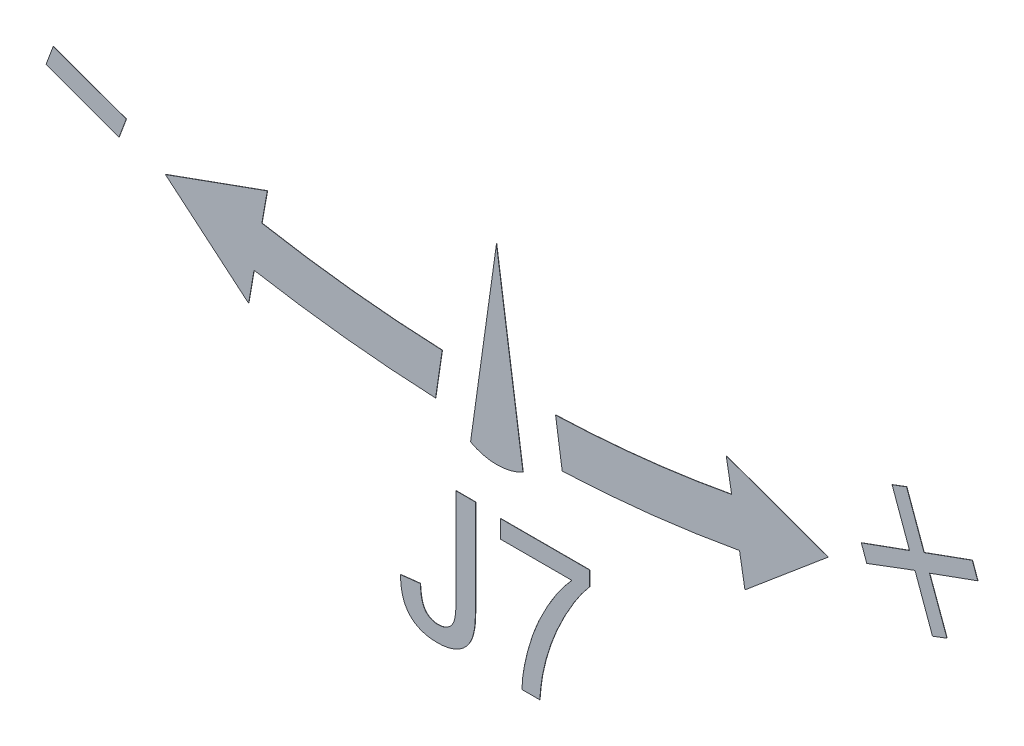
from build123d import *

# Parameters (mm, degrees)
BOSS_EXTRUDE1_DEPTH   = 0.25
BOSS_EXTRUDE1_2_DEPTH = 0.25
BOSS_EXTRUDE2_DEPTH   = 0.25
BOSS_EXTRUDE2_2_DEPTH = 0.25
BOSS_EXTRUDE2_3_DEPTH = 0.25
BOSS_EXTRUDE2_4_DEPTH = 0.25
BOSS_EXTRUDE2_5_DEPTH = 0.25
SCALE1_SCALE          = 0.040197


with BuildPart() as part:
    # Sketch3 → Boss-Extrude1 (new body)
    with BuildSketch(Plane.XY):
        with BuildLine():
            Line((4414.576181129, 1815.791045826), (4432.063360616, 1817.75338557))
            add(Edge.make_bspline(
                [(4432.063360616, 1817.75338557), (4432.110607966, 1816.651475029), (4432.200990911, 1814.543548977), (4432.500644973, 1811.517332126), (4432.918954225, 1808.764913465), (4433.436964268, 1806.276241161), (4434.040434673, 1804.049587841), (4434.79758805, 1802.102917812), (4435.613036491, 1800.395330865), (4436.615641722, 1798.979945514), (4437.69060692, 1797.770283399), (4438.873162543, 1796.743166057), (4440.148053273, 1795.867922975), (4441.512738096, 1795.144904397), (4442.982571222, 1794.590316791), (4444.542273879, 1794.205080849), (4446.204703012, 1793.938391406), (4447.346964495, 1793.917832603), (4447.93595677, 1793.907231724)],
                knots=[0, 0, 0, 0, 1.632619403, 3.123158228, 4.499702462, 5.75227728, 6.885496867, 7.90993266, 8.841891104, 9.678429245, 10.468404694, 11.232957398, 11.991194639, 12.753385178, 13.513799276, 14.310593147, 15.128879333, 16, 16, 16, 16], degree=3))
            add(Edge.make_bspline(
                [(4447.93595677, 1793.907231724), (4448.792276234, 1793.935888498), (4450.46552378, 1793.991883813), (4452.865600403, 1794.567384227), (4455.10189284, 1795.430836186), (4457.111151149, 1796.691604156), (4458.902543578, 1798.225712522), (4460.426345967, 1800.036056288), (4461.587077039, 1802.128236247), (4462.318129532, 1804.059889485), (4462.766562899, 1805.779153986), (4463.060038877, 1807.272715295), (4463.307454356, 1808.938944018), (4463.494331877, 1810.78828321), (4463.684056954, 1812.815367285), (4463.759850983, 1815.029057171), (4463.848195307, 1817.413230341), (4463.85480964, 1819.061500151), (4463.858232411, 1819.914443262)],
                knots=[0, 0, 0, 0, 1.177507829, 2.300849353, 3.381033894, 4.466744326, 5.550475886, 6.619462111, 7.707386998, 8.830091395, 9.455333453, 10.153234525, 10.925888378, 11.774835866, 12.713513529, 13.729654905, 14.82514671, 16, 16, 16, 16], degree=3))
            Line((4463.858232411, 1819.914443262), (4463.858232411, 1905.189283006))
            Line((4463.858232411, 1905.189283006), (4481.345411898, 1905.189283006))
            Line((4481.345411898, 1905.189283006), (4481.345411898, 1821.032231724))
            add(Edge.make_bspline(
                [(4481.345411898, 1821.032231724), (4481.33826824, 1819.773493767), (4481.324443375, 1817.337503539), (4481.150115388, 1813.790618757), (4480.846920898, 1810.461095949), (4480.466055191, 1807.341630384), (4479.943616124, 1804.438814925), (4479.29731468, 1801.762333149), (4478.564893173, 1799.290452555), (4477.415320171, 1796.340231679), (4475.665037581, 1792.993156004), (4472.986793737, 1789.443328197), (4469.74972764, 1786.415066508), (4465.990537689, 1783.922695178), (4461.799435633, 1781.999223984), (4457.248675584, 1780.60269331), (4452.348779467, 1779.738468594), (4448.95804093, 1779.646698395), (4447.215604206, 1779.599539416)],
                knots=[0, 0, 0, 0, 0.979376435, 1.895351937, 2.762129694, 3.580429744, 4.339931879, 5.055623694, 5.722093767, 6.344240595, 7.517202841, 8.648554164, 9.788057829, 10.949533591, 12.142879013, 13.363546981, 14.645176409, 16, 16, 16, 16], degree=3))
            add(Edge.make_bspline(
                [(4447.215604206, 1779.599539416), (4445.922542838, 1779.62778786), (4443.403805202, 1779.682812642), (4439.741987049, 1780.120221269), (4436.3010386, 1780.778059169), (4433.123744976, 1781.836196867), (4430.145645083, 1783.074237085), (4427.42438489, 1784.665391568), (4424.913384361, 1786.501247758), (4422.676218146, 1788.660512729), (4420.658904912, 1791.073042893), (4418.990808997, 1793.814014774), (4417.516645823, 1796.784257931), (4416.403723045, 1800.066503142), (4415.490830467, 1803.599877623), (4414.926172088, 1807.42946312), (4414.555284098, 1811.519435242), (4414.569088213, 1814.341166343), (4414.576181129, 1815.791045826)],
                knots=[0, 0, 0, 0, 1.110149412, 2.162445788, 3.163771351, 4.112774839, 5.033433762, 5.928696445, 6.813333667, 7.698542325, 8.592646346, 9.506220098, 10.44759987, 11.434914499, 12.476633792, 13.577933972, 14.755478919, 16, 16, 16, 16], degree=3))
        make_face()
    extrude(amount=BOSS_EXTRUDE1_DEPTH)


with BuildPart() as body_2:
    # Sketch3 → Boss-Extrude1 2 (new body)
    with BuildSketch(Plane.XY):
        with BuildLine():
            Line((4503.601822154, 1887.702103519), (4503.601822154, 1903.599539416))
            Line((4503.601822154, 1903.599539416), (4583.089001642, 1903.599539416))
            Line((4583.089001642, 1903.599539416), (4583.089001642, 1890.732552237))
            add(Edge.make_bspline(
                [(4583.089001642, 1890.732552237), (4582.153230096, 1889.638245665), (4580.239905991, 1887.40077312), (4577.468065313, 1883.836838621), (4574.681821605, 1880.042464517), (4571.930148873, 1875.981164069), (4569.171931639, 1871.682576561), (4566.418270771, 1867.132973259), (4563.657924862, 1862.343435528), (4560.037177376, 1855.637149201), (4555.717438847, 1847.051411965), (4551.228820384, 1836.472238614), (4547.243964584, 1825.787621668), (4545.123405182, 1818.521055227), (4544.065764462, 1814.896815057)],
                knots=[0, 0, 0, 0, 0.603281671, 1.233499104, 1.891379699, 2.575603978, 3.288773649, 4.031381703, 4.80386477, 5.604951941, 7.224880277, 8.828980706, 10.418436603, 12, 12, 12, 12], degree=3))
            add(Edge.make_bspline(
                [(4544.065764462, 1814.896815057), (4543.379839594, 1812.279385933), (4541.984413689, 1806.954563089), (4540.456852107, 1798.685787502), (4539.275820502, 1790.064343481), (4538.812051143, 1784.181339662), (4538.576181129, 1781.189283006)],
                knots=[0, 0, 0, 0, 0.948866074, 1.930345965, 2.947387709, 4, 4, 4, 4], degree=3))
            Line((4538.576181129, 1781.189283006), (4522.678745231, 1781.189283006))
            add(Edge.make_bspline(
                [(4522.678745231, 1781.189283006), (4522.716876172, 1782.423640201), (4522.795290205, 1784.962023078), (4523.142043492, 1788.862518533), (4523.603887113, 1792.956838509), (4524.256202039, 1797.231151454), (4525.085347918, 1801.694133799), (4526.073383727, 1806.350512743), (4527.253387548, 1811.190657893), (4528.998545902, 1817.901201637), (4531.590389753, 1826.339156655), (4535.363926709, 1836.316264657), (4539.703596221, 1846.122165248), (4543.845474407, 1854.074231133), (4547.377483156, 1860.266665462), (4550.057788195, 1864.759754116), (4552.814312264, 1869.041170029), (4555.595951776, 1873.141712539), (4558.403188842, 1877.064834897), (4561.293208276, 1880.773866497), (4564.180802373, 1884.343321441), (4566.196828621, 1886.592383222), (4567.191565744, 1887.702103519)],
                knots=[0, 0, 0, 0, 0.630312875, 1.296201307, 1.998242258, 2.7335219, 3.502880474, 4.315318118, 5.163159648, 6.045885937, 7.85484959, 9.666009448, 11.488277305, 13.325849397, 14.240191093, 15.127469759, 15.996293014, 16.839220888, 17.656853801, 18.458354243, 19.239329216, 20, 20, 20, 20], degree=3))
            Line((4567.191565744, 1887.702103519), (4503.601822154, 1887.702103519))
        make_face()
    extrude(amount=BOSS_EXTRUDE1_2_DEPTH)


with BuildPart() as body_3:
    # Sketch2 → Boss-Extrude2 (new body)
    with BuildSketch(Plane.XY):
        Polygon((4169.8841418, 2045.1572), (4104.8305, 2068.8130582), (4098.3789, 2051.6088), (4163.4325418, 2027.9529418), align=None)
    extrude(amount=BOSS_EXTRUDE2_DEPTH)


with BuildPart() as body_4:
    # Sketch2 → Boss-Extrude2 2 (new body)
    with BuildSketch(Plane.XY):
        with BuildLine():
            Line((4295.6903418, 2052.6840582), (4204.8303, 2019.8884418))
            Line((4204.8303, 2019.8884418), (4279.0237, 1957.5229582))
            Line((4279.0237, 1957.5229582), (4283.8624, 1985.4799))
            ThreePointArc((4283.8624, 1985.4799), (4364.489380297, 1973.992615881), (4445.6900418, 1967.738))
            Line((4445.6900418, 1967.738), (4451.604, 2007.5228582))
            ThreePointArc((4451.604, 2007.5228582), (4370.919166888, 2013.597215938), (4290.8516418, 2025.2647582))
            Line((4290.8516418, 2025.2647582), (4295.6903418, 2052.6840582))
        make_face()
    extrude(amount=BOSS_EXTRUDE2_2_DEPTH)


with BuildPart() as body_5:
    # Sketch2 → Boss-Extrude2 3 (new body)
    with BuildSketch(Plane.XY):
        with BuildLine():
            Line((4499.991, 2113.9742582), (4476.8727582, 1949.4584582))
            ThreePointArc((4476.8727582, 1949.4584582), (4500.2598082, 1943.5445), (4523.6468582, 1949.4584582))
            Line((4523.6468582, 1949.4584582), (4499.991, 2113.9742582))
        make_face()
    extrude(amount=BOSS_EXTRUDE2_3_DEPTH)


with BuildPart() as body_6:
    # Sketch2 → Boss-Extrude2 4 (new body)
    with BuildSketch(Plane.XY):
        with BuildLine():
            Line((4552.6790582, 2008.0605), (4558.5930418, 1967.738))
            ThreePointArc((4558.5930418, 1967.738), (4637.929920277, 1973.893650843), (4716.6572418, 1985.4799))
            Line((4716.6572418, 1985.4799), (4721.4959418, 1957.5229582))
            Line((4721.4959418, 1957.5229582), (4795.6893418, 2019.8884418))
            Line((4795.6893418, 2019.8884418), (4704.8293, 2052.6840582))
            Line((4704.8293, 2052.6840582), (4709.668, 2025.2647582))
            ThreePointArc((4709.668, 2025.2647582), (4631.496787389, 2013.712895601), (4552.6790582, 2008.0605))
        make_face()
    extrude(amount=BOSS_EXTRUDE2_4_DEPTH)


with BuildPart() as body_7:
    # Sketch2 → Boss-Extrude2 5 (new body)
    with BuildSketch(Plane.XY):
        Polygon((4825.2591582, 2045.6948418), (4830.0978582, 2032.254), (4873.1085418, 2048.383), (4888.6999, 2005.3723418), (4901.6031, 2010.2110418), (4886.0117418, 2052.6840582), (4929.0224, 2068.2754418), (4924.1837, 2081.7162582), (4881.1730418, 2066.1249), (4865.5816582, 2109.1355582), (4852.6784582, 2104.2968582), (4868.2698418, 2061.2862), align=None)
    extrude(amount=BOSS_EXTRUDE2_5_DEPTH)


with BuildPart() as body_7_1:
    # Scale1: scaled about (0, 0, 0)
    add(body_7.part.scale(SCALE1_SCALE))


with BuildPart() as body_6_1:
    # Scale1: scaled about (0, 0, 0)
    add(body_6.part.scale(SCALE1_SCALE))


with BuildPart() as body_5_1:
    # Scale1: scaled about (0, 0, 0)
    add(body_5.part.scale(SCALE1_SCALE))


with BuildPart() as body_4_1:
    # Scale1: scaled about (0, 0, 0)
    add(body_4.part.scale(SCALE1_SCALE))


with BuildPart() as body_3_1:
    # Scale1: scaled about (0, 0, 0)
    add(body_3.part.scale(SCALE1_SCALE))


with BuildPart() as body_2_1:
    # Scale1: scaled about (0, 0, 0)
    add(body_2.part.scale(SCALE1_SCALE))


with BuildPart() as part_1:
    # Scale1: scaled about (0, 0, 0)
    add(part.part.scale(SCALE1_SCALE))


solid = Compound([body_7_1.part, body_6_1.part, body_5_1.part, body_4_1.part, body_3_1.part, body_2_1.part, part_1.part])
